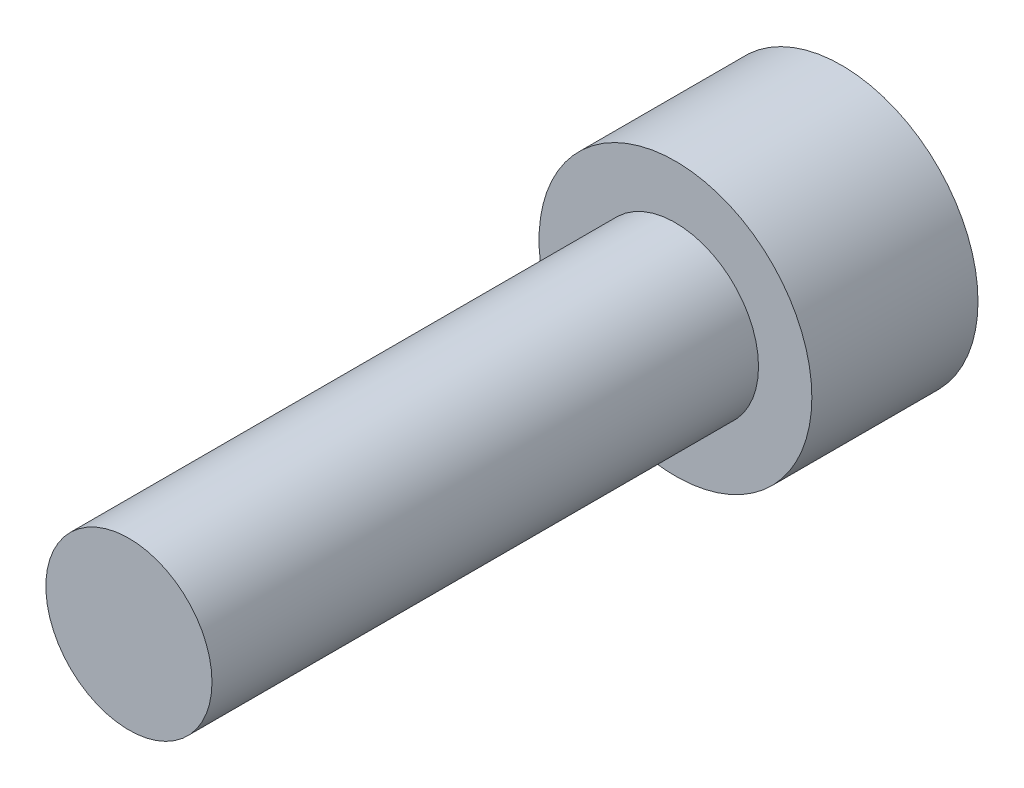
from build123d import *

# Parameters (mm, degrees)
HEX_2_DEPTH = 3.048


with BuildPart() as part:
    # Sketch6 → Revolve1 (revolve)
    with BuildSketch(Plane(origin=(0, 0, 0), x_dir=(0, 0, -1), z_dir=(1, 0, 0)), mode=Mode.PRIVATE) as revolve1_sk:
        Polygon((-15.875, 0), (-15.875, -2.413), (0, -2.413), (0, -3.9624), (4.826, -3.9624), (4.826, 0), align=None)
    revolve(revolve1_sk.sketch.rotate(Axis((0, 0, 15.875), (0, 0, -1)), 270), axis=Axis((0, 0, 15.875), (0, 0, -1)))

    # Sketch7 → HEX 2 (cut)
    with BuildSketch(Plane(origin=(0, 0, -4.826), x_dir=(-1, 0, 0), z_dir=(0, 0, -1))):
        Polygon((-1.9812, 1.143846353), (-1.9812, -1.143846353), (0, -2.287692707), (1.9812, -1.143846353), (1.9812, 1.143846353), (0, 2.287692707), align=None)
    extrude(amount=-HEX_2_DEPTH, mode=Mode.SUBTRACT)


solid = part.part
